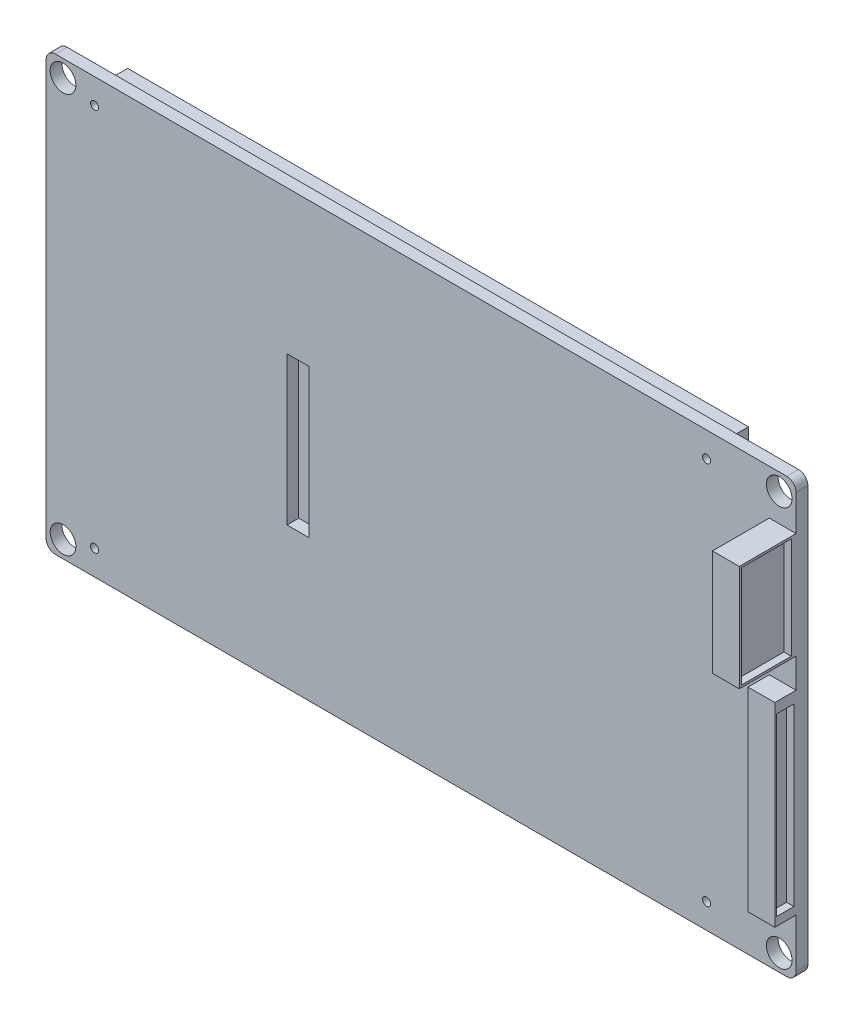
from build123d import *

# Parameters (mm, degrees)
SKETCH_1_W          = 102.1
SKETCH_1_H          = 59
SKETCH_1_R          = 0.55
SKETCH_1_W_2        = 3
SKETCH_1_H_2        = 20.199999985
SKETCH_1_R_2        = 1.75
EXTRUDE_1_DEPTH     = 1.6
FILLET_1_R          = 1.27
SKETCH_1_4_W        = 3.651751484
SKETCH_1_4_H        = 14.43
EXTRUDE_2_DEPTH     = 9.34
SKETCH_1_5_W        = 3.651751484
SKETCH_1_5_H        = 26.5
EXTRUDE_3_DEPTH     = 4.5
SKETCH_1_6_W        = 73.44
SKETCH_1_6_H        = 48.96
EXTRUDE_4_DEPTH     = 3.51
EXTRUDE_START       = -3.5
SKETCH_1_7_W        = 84.52
SKETCH_1_7_H        = 55.26
SKETCH_1_7_R        = 0.55
SKETCH_1_7_W_2      = 73.44
SKETCH_1_7_H_2      = 48.96
EXTRUDE_5_DEPTH     = 3.5
SKETCH_2_W          = 2.34
SKETCH_2_H          = 23.89
SKETCH_2_W_2        = 6.78
SKETCH_2_H_2        = 13.83
CUT_EXTRUDE_4_DEPTH = 1


with BuildPart() as part:
    # Sketch 1 → Extrude 1 (new body)
    with BuildSketch(Plane.XY):
        with Locations((-51.05, 29.5)):
            Rectangle(SKETCH_1_W, SKETCH_1_H)
        with Locations((-95.50000887, 3.4)):
            Circle(SKETCH_1_R, mode=Mode.SUBTRACT)
        with Locations((-12.18, 3.4)):
            Circle(SKETCH_1_R, mode=Mode.SUBTRACT)
        with Locations((-95.50000887, 55.6)):
            Circle(SKETCH_1_R, mode=Mode.SUBTRACT)
        with Locations((-12.18, 55.6)):
            Circle(SKETCH_1_R, mode=Mode.SUBTRACT)
        with Locations((-67.81, 29.339999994)):
            Rectangle(SKETCH_1_W_2, SKETCH_1_H_2, mode=Mode.SUBTRACT)
        with Locations((-99.8, 2.3)):
            Circle(SKETCH_1_R_2, mode=Mode.SUBTRACT)
        with Locations((-2.3, 2.3)):
            Circle(SKETCH_1_R_2, mode=Mode.SUBTRACT)
        with Locations((-99.8, 56.7)):
            Circle(SKETCH_1_R_2, mode=Mode.SUBTRACT)
        with Locations((-2.3, 56.7)):
            Circle(SKETCH_1_R_2, mode=Mode.SUBTRACT)
    extrude(amount=EXTRUDE_1_DEPTH)

    # Fillet 1
    fillet_1_edges = [part.edges().sort_by_distance(p)[0] for p in [
        (0, 0, 0.8),
        (-102.1, 0, 0.8),
        (-102.1, 59, 0.8),
        (0, 59, 0.8),
    ]]
    fillet(fillet_1_edges, radius=FILLET_1_R)

    # Sketch 1_4 → Extrude 2 (add)
    with BuildSketch(Plane.XY):
        with Locations((-1.825875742, 45.665)):
            Rectangle(SKETCH_1_4_W, SKETCH_1_4_H)
    extrude(amount=EXTRUDE_2_DEPTH)

    # Sketch 1_5 → Extrude 3 (add)
    with BuildSketch(Plane.XY):
        with Locations((-1.825875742, 21.161)):
            Rectangle(SKETCH_1_5_W, SKETCH_1_5_H)
    extrude(amount=EXTRUDE_3_DEPTH)

    # Sketch 1_6 → Extrude 4 (add)
    with BuildSketch(Plane.XY):
        with Locations((-51.049999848, 29.5)):
            Rectangle(SKETCH_1_6_W, SKETCH_1_6_H)
    extrude(amount=-EXTRUDE_4_DEPTH)

    # Sketch 1_7 → Extrude 5 (add)
    # profile 1 of 5: a face of its own
    with BuildSketch(Plane.XY.offset(EXTRUDE_START)):
        with Locations((-53.84, 29.5)):
            Rectangle(SKETCH_1_7_W, SKETCH_1_7_H)
        with Locations((-12.18, 3.4)):
            Circle(SKETCH_1_7_R, mode=Mode.SUBTRACT)
        with Locations((-95.50000887, 3.4)):
            Circle(SKETCH_1_7_R, mode=Mode.SUBTRACT)
        with Locations((-95.50000887, 55.6)):
            Circle(SKETCH_1_7_R, mode=Mode.SUBTRACT)
        with Locations((-12.18, 55.6)):
            Circle(SKETCH_1_7_R, mode=Mode.SUBTRACT)
        with Locations((-51.049999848, 29.5)):
            Rectangle(SKETCH_1_7_W_2, SKETCH_1_7_H_2, mode=Mode.SUBTRACT)
    # profile 2 of 5: a face of its own
    with BuildSketch(Plane.XY.offset(EXTRUDE_START)):
        with Locations((-95.50000887, 55.6)):
            Circle(SKETCH_1_7_R)
    # profile 3 of 5: a face of its own
    with BuildSketch(Plane.XY.offset(EXTRUDE_START)):
        with Locations((-12.18, 55.6)):
            Circle(SKETCH_1_7_R)
    # profile 4 of 5: a face of its own
    with BuildSketch(Plane.XY.offset(EXTRUDE_START)):
        with Locations((-12.18, 3.4)):
            Circle(SKETCH_1_7_R)
    # profile 5 of 5: a face of its own
    with BuildSketch(Plane.XY.offset(EXTRUDE_START)):
        with Locations((-95.50000887, 3.4)):
            Circle(SKETCH_1_7_R)
    extrude(amount=EXTRUDE_5_DEPTH)

    # Sketch 2 → Cut-Extrude 4 (cut)
    with BuildSketch(Plane(origin=(0, 0, 0), x_dir=(0, 0, -1), z_dir=(1, 0, 0))):
        with Locations((-3.07, 21.006)):
            Rectangle(SKETCH_2_W, SKETCH_2_H)
        with Locations((-5.65, 45.665)):
            Rectangle(SKETCH_2_W_2, SKETCH_2_H_2)
    extrude(amount=-CUT_EXTRUDE_4_DEPTH, mode=Mode.SUBTRACT)


solid = part.part
